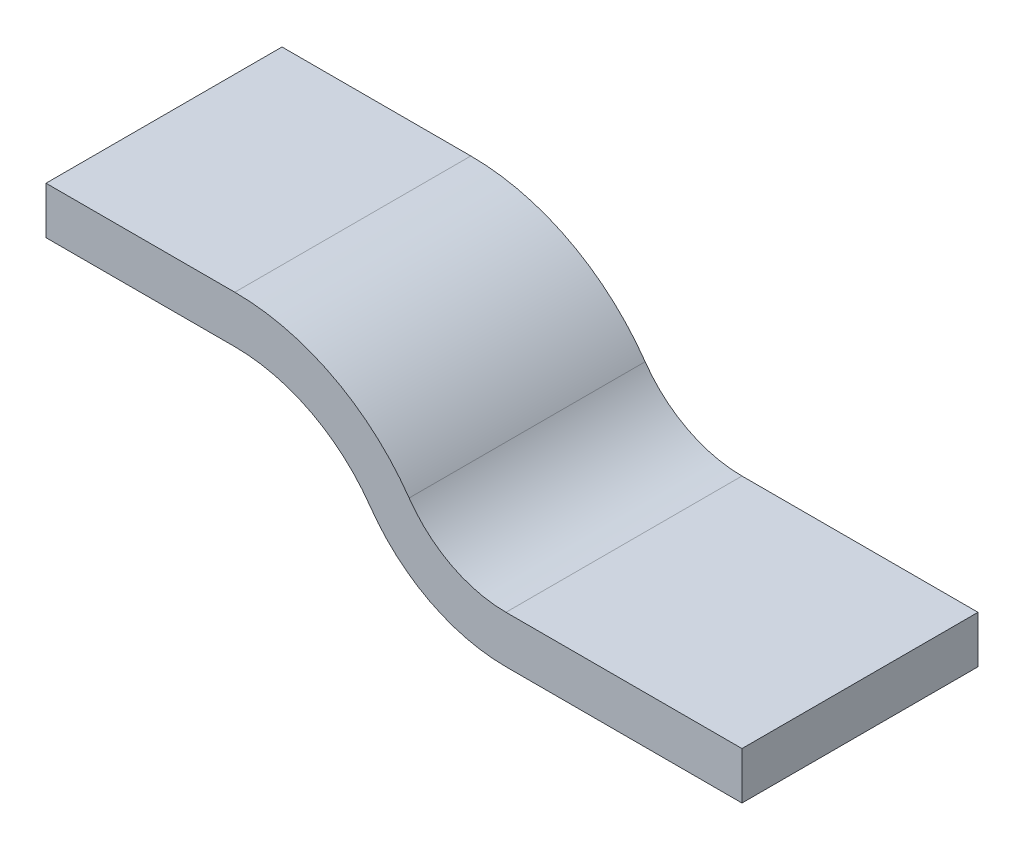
from build123d import *

# Parameters (mm, degrees)
EXTRUDE_THIN1_DEPTH = 25


with BuildPart() as part:
    # Sketch1 → Extrude-Thin1 (new, symmetric)
    with BuildSketch(Plane.XY):
        with BuildLine():
            Line((0, -5), (40, -5))
            ThreePointArc((40, -5), (56.201851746, -8.975815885), (68.722813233, -20))
            ThreePointArc((68.722813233, -20), (81.243774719, -31.024184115), (97.445626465, -35))
            Line((97.445626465, -35), (147.445626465, -35))
            Line((147.445626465, -35), (147.445626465, -25))
            Line((147.445626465, -25), (97.445626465, -25))
            ThreePointArc((97.445626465, -25), (85.872875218, -22.160131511), (76.929331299, -14.285714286))
            ThreePointArc((76.929331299, -14.285714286), (60.830952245, -0.111763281), (40, 5))
            Line((40, 5), (0, 5))
            Line((0, 5), (0, -5))
        make_face()
    extrude(amount=EXTRUDE_THIN1_DEPTH, both=True)


solid = part.part
